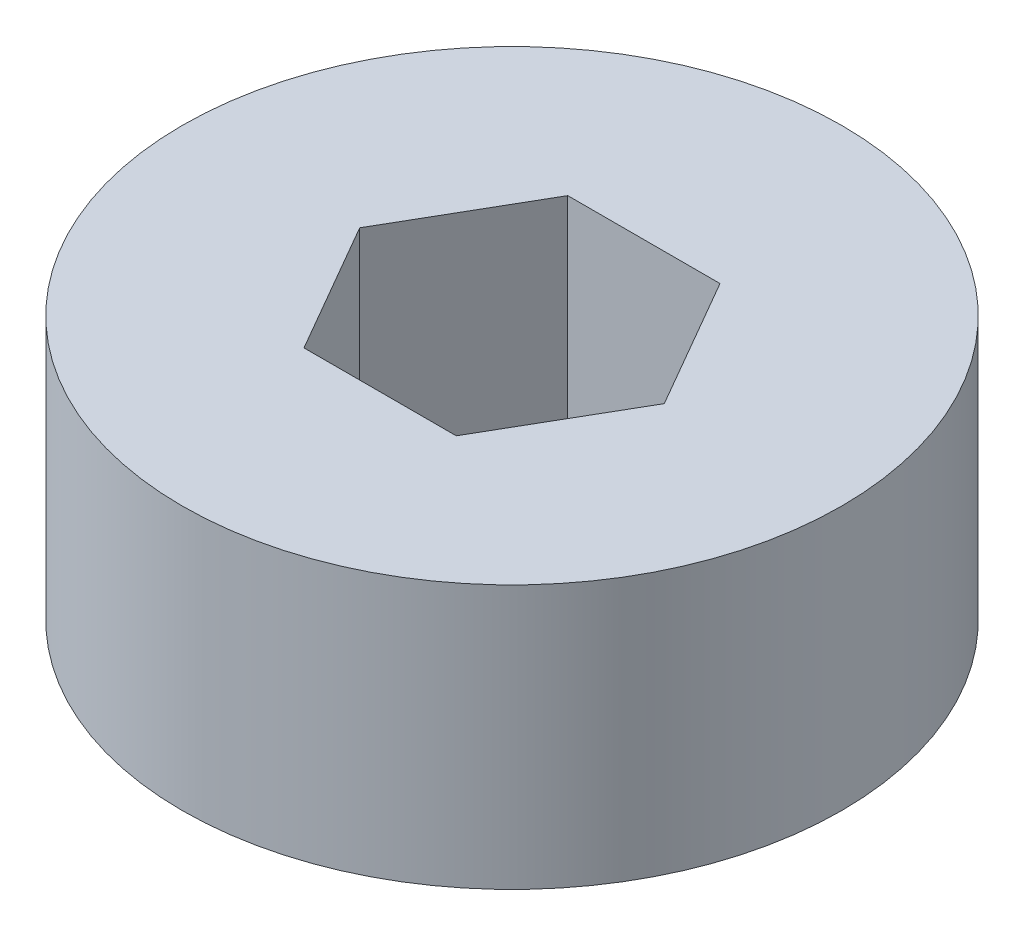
from build123d import *

# Parameters (mm, degrees)
SKETCH1_R          = 12.5
BASE_EXTRUDE_DEPTH = 10
HEX_2_DEPTH        = 21.310096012


with BuildPart() as part:
    # Sketch1 → Base-Extrude (new body)
    with BuildSketch(Plane(origin=(0, 0, 0), x_dir=(1, 0, 0), z_dir=(0, 1, 0))):
        with Locations(Location((0, 0, 0), (0, 0, 270))):
            Circle(SKETCH1_R)
    extrude(amount=BASE_EXTRUDE_DEPTH)

    # Sketch2 → Hex 2 (cut, through all)
    with BuildSketch(Plane(origin=(0, 10, 0), x_dir=(-1, 0, 0), z_dir=(0, 1, 0))):
        Polygon((-5.773502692, 0), (-2.886751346, -5), (2.886751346, -5), (5.773502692, 0), (2.886751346, 5), (-2.886751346, 5), align=None)
    extrude(amount=-HEX_2_DEPTH, mode=Mode.SUBTRACT)


solid = part.part
